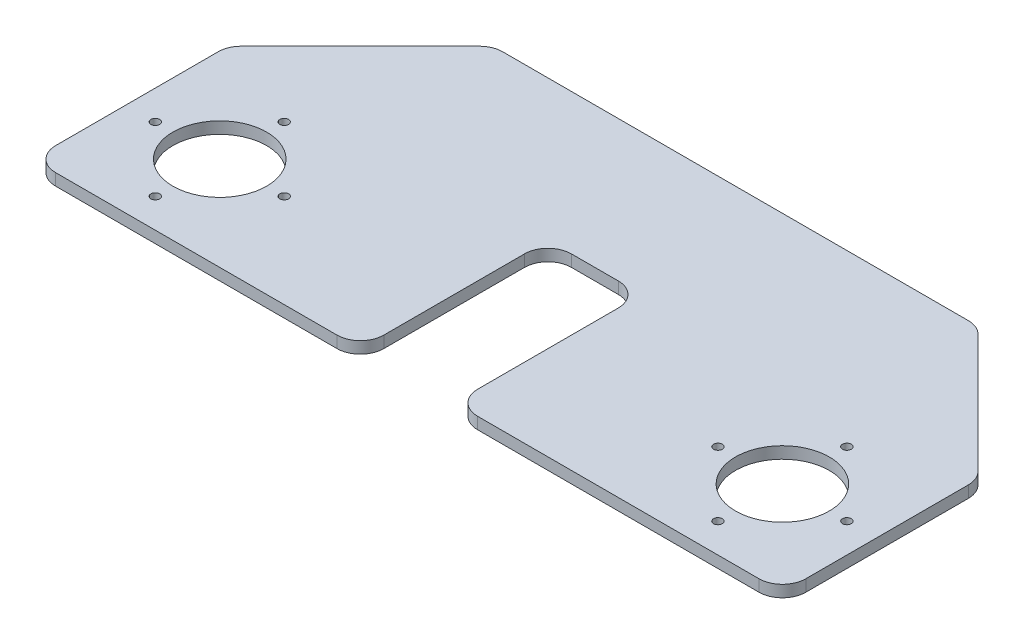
ISO-10303-21;
HEADER;
FILE_DESCRIPTION(('STEP AP214'),'2;1');
FILE_NAME('part.step','',(''),(''),'','','');
FILE_SCHEMA(('AUTOMOTIVE_DESIGN { 1 0 10303 214 1 1 1 1 }'));
ENDSEC;
DATA;
#1=APPLICATION_CONTEXT('core data for automotive mechanical design processes');
#2=APPLICATION_PROTOCOL_DEFINITION('international standard','automotive_design',2000,#1);
#3=PRODUCT_CONTEXT('',#1,'mechanical');
#4=PRODUCT('Part','Part','',(#3));
#5=PRODUCT_RELATED_PRODUCT_CATEGORY('part','',(#4));
#6=PRODUCT_DEFINITION_FORMATION('','',#4);
#7=PRODUCT_DEFINITION_CONTEXT('part definition',#1,'design');
#8=PRODUCT_DEFINITION('design','',#6,#7);
#9=PRODUCT_DEFINITION_SHAPE('','',#8);
#10=(LENGTH_UNIT() NAMED_UNIT(*) SI_UNIT(.MILLI.,.METRE.));
#11=(NAMED_UNIT(*) PLANE_ANGLE_UNIT() SI_UNIT($,.RADIAN.));
#12=(NAMED_UNIT(*) SI_UNIT($,.STERADIAN.) SOLID_ANGLE_UNIT());
#13=UNCERTAINTY_MEASURE_WITH_UNIT(LENGTH_MEASURE(1.E-05),#10,'distance_accuracy_value','');
#14=(GEOMETRIC_REPRESENTATION_CONTEXT(3) GLOBAL_UNCERTAINTY_ASSIGNED_CONTEXT((#13)) GLOBAL_UNIT_ASSIGNED_CONTEXT((#10,
#11,#12)) REPRESENTATION_CONTEXT('',''));
#15=CARTESIAN_POINT('',(0.,0.,0.));
#16=DIRECTION('',(0.,0.,1.));
#17=DIRECTION('',(1.,0.,0.));
#18=AXIS2_PLACEMENT_3D('',#15,#16,#17);
#19=CARTESIAN_POINT('',(-203.2,-6.35000000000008,50.8));
#20=DIRECTION('',(-1.,0.,0.));
#21=DIRECTION('',(0.,0.,1.));
#22=AXIS2_PLACEMENT_3D('',#19,#20,#21);
#23=PLANE('',#22);
#24=DIRECTION('',(0.,0.,1.));
#25=VECTOR('',#24,1.);
#26=CARTESIAN_POINT('',(-203.2,0.,50.8));
#27=LINE('',#26,#25);
#28=CARTESIAN_POINT('',(-203.2,0.,-49.8974387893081));
#29=VERTEX_POINT('',#28);
#30=CARTESIAN_POINT('',(-203.2,0.,38.1));
#31=VERTEX_POINT('',#30);
#32=EDGE_CURVE('E320',#29,#31,#27,.T.);
#33=ORIENTED_EDGE('',*,*,#32,.F.);
#34=DIRECTION('',(0.,1.,0.));
#35=VECTOR('',#34,1.);
#36=CARTESIAN_POINT('',(-203.2,-6.35000000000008,-49.8974387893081));
#37=LINE('',#36,#35);
#38=CARTESIAN_POINT('',(-203.2,-6.35000000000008,-49.8974387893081));
#39=VERTEX_POINT('',#38);
#40=EDGE_CURVE('E271',#29,#39,#37,.F.);
#41=ORIENTED_EDGE('',*,*,#40,.T.);
#42=DIRECTION('',(0.,0.,1.));
#43=VECTOR('',#42,1.);
#44=CARTESIAN_POINT('',(-203.2,-6.35000000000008,50.8));
#45=LINE('',#44,#43);
#46=CARTESIAN_POINT('',(-203.2,-6.35000000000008,38.1));
#47=VERTEX_POINT('',#46);
#48=EDGE_CURVE('E337',#39,#47,#45,.T.);
#49=ORIENTED_EDGE('',*,*,#48,.T.);
#50=DIRECTION('',(0.,1.,0.));
#51=VECTOR('',#50,1.);
#52=CARTESIAN_POINT('',(-203.2,-6.35000000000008,38.1));
#53=LINE('',#52,#51);
#54=EDGE_CURVE('E268',#47,#31,#53,.T.);
#55=ORIENTED_EDGE('',*,*,#54,.T.);
#56=EDGE_LOOP('',(#33,#41,#49,#55));
#57=FACE_BOUND('',#56,.T.);
#58=ADVANCED_FACE('F32',(#57),#23,.T.);
#59=CARTESIAN_POINT('',(-131.357951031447,-6.35000000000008,-127.));
#60=DIRECTION('',(-0.707106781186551,0.,-0.707106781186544));
#61=DIRECTION('',(-0.707106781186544,0.,0.707106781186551));
#62=AXIS2_PLACEMENT_3D('',#59,#60,#61);
#63=PLANE('',#62);
#64=DIRECTION('',(-0.707106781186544,0.,0.707106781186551));
#65=VECTOR('',#64,1.);
#66=CARTESIAN_POINT('',(-131.357951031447,0.,-127.));
#67=LINE('',#66,#65);
#68=CARTESIAN_POINT('',(-135.077694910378,0.,-123.280256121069));
#69=VERTEX_POINT('',#68);
#70=CARTESIAN_POINT('',(-199.480256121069,0.,-58.8776949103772));
#71=VERTEX_POINT('',#70);
#72=EDGE_CURVE('E201',#69,#71,#67,.T.);
#73=ORIENTED_EDGE('',*,*,#72,.F.);
#74=DIRECTION('',(0.,1.,0.));
#75=VECTOR('',#74,1.);
#76=CARTESIAN_POINT('',(-135.077694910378,-6.35000000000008,-123.280256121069));
#77=LINE('',#76,#75);
#78=CARTESIAN_POINT('',(-135.077694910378,-6.35000000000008,-123.280256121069));
#79=VERTEX_POINT('',#78);
#80=EDGE_CURVE('E266',#69,#79,#77,.F.);
#81=ORIENTED_EDGE('',*,*,#80,.T.);
#82=DIRECTION('',(-0.707106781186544,0.,0.707106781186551));
#83=VECTOR('',#82,1.);
#84=CARTESIAN_POINT('',(-131.357951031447,-6.35000000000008,-127.));
#85=LINE('',#84,#83);
#86=CARTESIAN_POINT('',(-199.480256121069,-6.35000000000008,-58.8776949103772));
#87=VERTEX_POINT('',#86);
#88=EDGE_CURVE('E193',#79,#87,#85,.T.);
#89=ORIENTED_EDGE('',*,*,#88,.T.);
#90=DIRECTION('',(0.,1.,0.));
#91=VECTOR('',#90,1.);
#92=CARTESIAN_POINT('',(-199.480256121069,-6.35000000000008,-58.8776949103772));
#93=LINE('',#92,#91);
#94=EDGE_CURVE('E263',#87,#71,#93,.T.);
#95=ORIENTED_EDGE('',*,*,#94,.T.);
#96=EDGE_LOOP('',(#73,#81,#89,#95));
#97=FACE_BOUND('',#96,.T.);
#98=ADVANCED_FACE('F450',(#97),#63,.T.);
#99=CARTESIAN_POINT('',(-131.357951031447,-6.35000000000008,-127.));
#100=DIRECTION('',(0.,0.,-1.));
#101=DIRECTION('',(-1.,0.,0.));
#102=AXIS2_PLACEMENT_3D('',#99,#100,#101);
#103=PLANE('',#102);
#104=DIRECTION('',(-1.,0.,0.));
#105=VECTOR('',#104,1.);
#106=CARTESIAN_POINT('',(-131.357951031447,0.,-127.));
#107=LINE('',#106,#105);
#108=CARTESIAN_POINT('',(126.097438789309,0.,-127.));
#109=VERTEX_POINT('',#108);
#110=CARTESIAN_POINT('',(-126.097438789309,0.,-127.));
#111=VERTEX_POINT('',#110);
#112=EDGE_CURVE('E333',#109,#111,#107,.T.);
#113=ORIENTED_EDGE('',*,*,#112,.F.);
#114=DIRECTION('',(0.,1.,0.));
#115=VECTOR('',#114,1.);
#116=CARTESIAN_POINT('',(126.097438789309,-6.35000000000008,-127.));
#117=LINE('',#116,#115);
#118=CARTESIAN_POINT('',(126.097438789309,-6.35000000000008,-127.));
#119=VERTEX_POINT('',#118);
#120=EDGE_CURVE('E261',#109,#119,#117,.F.);
#121=ORIENTED_EDGE('',*,*,#120,.T.);
#122=DIRECTION('',(-1.,0.,0.));
#123=VECTOR('',#122,1.);
#124=CARTESIAN_POINT('',(-131.357951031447,-6.35000000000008,-127.));
#125=LINE('',#124,#123);
#126=CARTESIAN_POINT('',(-126.097438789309,-6.35000000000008,-127.));
#127=VERTEX_POINT('',#126);
#128=EDGE_CURVE('E198',#119,#127,#125,.T.);
#129=ORIENTED_EDGE('',*,*,#128,.T.);
#130=DIRECTION('',(0.,1.,0.));
#131=VECTOR('',#130,1.);
#132=CARTESIAN_POINT('',(-126.097438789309,-6.35000000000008,-127.));
#133=LINE('',#132,#131);
#134=EDGE_CURVE('E258',#127,#111,#133,.T.);
#135=ORIENTED_EDGE('',*,*,#134,.T.);
#136=EDGE_LOOP('',(#113,#121,#129,#135));
#137=FACE_BOUND('',#136,.T.);
#138=ADVANCED_FACE('F455',(#137),#103,.T.);
#139=CARTESIAN_POINT('',(131.357951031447,-6.35000000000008,-127.));
#140=DIRECTION('',(0.707106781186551,0.,-0.707106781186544));
#141=DIRECTION('',(-0.707106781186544,0.,-0.707106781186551));
#142=AXIS2_PLACEMENT_3D('',#139,#140,#141);
#143=PLANE('',#142);
#144=DIRECTION('',(-0.707106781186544,0.,-0.707106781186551));
#145=VECTOR('',#144,1.);
#146=CARTESIAN_POINT('',(131.357951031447,0.,-127.));
#147=LINE('',#146,#145);
#148=CARTESIAN_POINT('',(199.480256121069,0.,-58.8776949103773));
#149=VERTEX_POINT('',#148);
#150=CARTESIAN_POINT('',(135.077694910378,0.,-123.280256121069));
#151=VERTEX_POINT('',#150);
#152=EDGE_CURVE('E331',#149,#151,#147,.T.);
#153=ORIENTED_EDGE('',*,*,#152,.F.);
#154=DIRECTION('',(0.,1.,0.));
#155=VECTOR('',#154,1.);
#156=CARTESIAN_POINT('',(199.480256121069,-6.35000000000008,-58.8776949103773));
#157=LINE('',#156,#155);
#158=CARTESIAN_POINT('',(199.480256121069,-6.35000000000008,-58.8776949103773));
#159=VERTEX_POINT('',#158);
#160=EDGE_CURVE('E256',#149,#159,#157,.F.);
#161=ORIENTED_EDGE('',*,*,#160,.T.);
#162=DIRECTION('',(-0.707106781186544,0.,-0.707106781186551));
#163=VECTOR('',#162,1.);
#164=CARTESIAN_POINT('',(131.357951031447,-6.35000000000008,-127.));
#165=LINE('',#164,#163);
#166=CARTESIAN_POINT('',(135.077694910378,-6.35000000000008,-123.280256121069));
#167=VERTEX_POINT('',#166);
#168=EDGE_CURVE('E315',#159,#167,#165,.T.);
#169=ORIENTED_EDGE('',*,*,#168,.T.);
#170=DIRECTION('',(0.,1.,0.));
#171=VECTOR('',#170,1.);
#172=CARTESIAN_POINT('',(135.077694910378,-6.35000000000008,-123.280256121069));
#173=LINE('',#172,#171);
#174=EDGE_CURVE('E253',#167,#151,#173,.T.);
#175=ORIENTED_EDGE('',*,*,#174,.T.);
#176=EDGE_LOOP('',(#153,#161,#169,#175));
#177=FACE_BOUND('',#176,.T.);
#178=ADVANCED_FACE('F512',(#177),#143,.T.);
#179=CARTESIAN_POINT('',(203.2,-6.35000000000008,50.8));
#180=DIRECTION('',(1.,0.,0.));
#181=DIRECTION('',(0.,0.,-1.));
#182=AXIS2_PLACEMENT_3D('',#179,#180,#181);
#183=PLANE('',#182);
#184=DIRECTION('',(0.,0.,-1.));
#185=VECTOR('',#184,1.);
#186=CARTESIAN_POINT('',(203.2,0.,50.8));
#187=LINE('',#186,#185);
#188=CARTESIAN_POINT('',(203.2,0.,38.0999999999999));
#189=VERTEX_POINT('',#188);
#190=CARTESIAN_POINT('',(203.2,0.,-49.8974387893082));
#191=VERTEX_POINT('',#190);
#192=EDGE_CURVE('E328',#189,#191,#187,.T.);
#193=ORIENTED_EDGE('',*,*,#192,.F.);
#194=DIRECTION('',(0.,1.,0.));
#195=VECTOR('',#194,1.);
#196=CARTESIAN_POINT('',(203.2,-6.35000000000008,38.0999999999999));
#197=LINE('',#196,#195);
#198=CARTESIAN_POINT('',(203.2,-6.35000000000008,38.0999999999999));
#199=VERTEX_POINT('',#198);
#200=EDGE_CURVE('E251',#189,#199,#197,.F.);
#201=ORIENTED_EDGE('',*,*,#200,.T.);
#202=DIRECTION('',(0.,0.,-1.));
#203=VECTOR('',#202,1.);
#204=CARTESIAN_POINT('',(203.2,-6.35000000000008,50.8));
#205=LINE('',#204,#203);
#206=CARTESIAN_POINT('',(203.2,-6.35000000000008,-49.8974387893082));
#207=VERTEX_POINT('',#206);
#208=EDGE_CURVE('E312',#199,#207,#205,.T.);
#209=ORIENTED_EDGE('',*,*,#208,.T.);
#210=DIRECTION('',(0.,1.,0.));
#211=VECTOR('',#210,1.);
#212=CARTESIAN_POINT('',(203.2,-6.35000000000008,-49.8974387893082));
#213=LINE('',#212,#211);
#214=EDGE_CURVE('E248',#207,#191,#213,.T.);
#215=ORIENTED_EDGE('',*,*,#214,.T.);
#216=EDGE_LOOP('',(#193,#201,#209,#215));
#217=FACE_BOUND('',#216,.T.);
#218=ADVANCED_FACE('F519',(#217),#183,.T.);
#219=CARTESIAN_POINT('',(25.4,-6.35000000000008,50.8));
#220=DIRECTION('',(0.,0.,1.));
#221=DIRECTION('',(1.,0.,0.));
#222=AXIS2_PLACEMENT_3D('',#219,#220,#221);
#223=PLANE('',#222);
#224=DIRECTION('',(1.,0.,0.));
#225=VECTOR('',#224,1.);
#226=CARTESIAN_POINT('',(25.4,0.,50.8));
#227=LINE('',#226,#225);
#228=CARTESIAN_POINT('',(38.1,0.,50.8));
#229=VERTEX_POINT('',#228);
#230=CARTESIAN_POINT('',(190.5,0.,50.8));
#231=VERTEX_POINT('',#230);
#232=EDGE_CURVE('E288',#229,#231,#227,.T.);
#233=ORIENTED_EDGE('',*,*,#232,.F.);
#234=DIRECTION('',(0.,1.,0.));
#235=VECTOR('',#234,1.);
#236=CARTESIAN_POINT('',(38.1,-6.35000000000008,50.8));
#237=LINE('',#236,#235);
#238=CARTESIAN_POINT('',(38.1,-6.35000000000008,50.8));
#239=VERTEX_POINT('',#238);
#240=EDGE_CURVE('E228',#229,#239,#237,.F.);
#241=ORIENTED_EDGE('',*,*,#240,.T.);
#242=DIRECTION('',(1.,0.,0.));
#243=VECTOR('',#242,1.);
#244=CARTESIAN_POINT('',(25.4,-6.35000000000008,50.8));
#245=LINE('',#244,#243);
#246=CARTESIAN_POINT('',(190.5,-6.35000000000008,50.8));
#247=VERTEX_POINT('',#246);
#248=EDGE_CURVE('E304',#239,#247,#245,.T.);
#249=ORIENTED_EDGE('',*,*,#248,.T.);
#250=DIRECTION('',(0.,1.,0.));
#251=VECTOR('',#250,1.);
#252=CARTESIAN_POINT('',(190.5,-6.35000000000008,50.8));
#253=LINE('',#252,#251);
#254=EDGE_CURVE('E225',#247,#231,#253,.T.);
#255=ORIENTED_EDGE('',*,*,#254,.T.);
#256=EDGE_LOOP('',(#233,#241,#249,#255));
#257=FACE_BOUND('',#256,.T.);
#258=ADVANCED_FACE('F525',(#257),#223,.T.);
#259=CARTESIAN_POINT('',(25.4,-6.35000000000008,50.8));
#260=DIRECTION('',(-1.,0.,0.));
#261=DIRECTION('',(0.,0.,1.));
#262=AXIS2_PLACEMENT_3D('',#259,#260,#261);
#263=PLANE('',#262);
#264=DIRECTION('',(0.,0.,1.));
#265=VECTOR('',#264,1.);
#266=CARTESIAN_POINT('',(25.4,0.,50.8));
#267=LINE('',#266,#265);
#268=CARTESIAN_POINT('',(25.4,0.,-38.1));
#269=VERTEX_POINT('',#268);
#270=CARTESIAN_POINT('',(25.4,0.,38.1));
#271=VERTEX_POINT('',#270);
#272=EDGE_CURVE('E278',#269,#271,#267,.T.);
#273=ORIENTED_EDGE('',*,*,#272,.F.);
#274=DIRECTION('',(0.,1.,0.));
#275=VECTOR('',#274,1.);
#276=CARTESIAN_POINT('',(25.4,-6.35000000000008,-38.1));
#277=LINE('',#276,#275);
#278=CARTESIAN_POINT('',(25.4,-6.35000000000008,-38.1));
#279=VERTEX_POINT('',#278);
#280=EDGE_CURVE('E211',#269,#279,#277,.F.);
#281=ORIENTED_EDGE('',*,*,#280,.T.);
#282=DIRECTION('',(0.,0.,1.));
#283=VECTOR('',#282,1.);
#284=CARTESIAN_POINT('',(25.4,-6.35000000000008,50.8));
#285=LINE('',#284,#283);
#286=CARTESIAN_POINT('',(25.4,-6.35000000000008,38.1));
#287=VERTEX_POINT('',#286);
#288=EDGE_CURVE('E298',#279,#287,#285,.T.);
#289=ORIENTED_EDGE('',*,*,#288,.T.);
#290=DIRECTION('',(0.,1.,0.));
#291=VECTOR('',#290,1.);
#292=CARTESIAN_POINT('',(25.4,-6.35000000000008,38.1));
#293=LINE('',#292,#291);
#294=EDGE_CURVE('E208',#287,#271,#293,.T.);
#295=ORIENTED_EDGE('',*,*,#294,.T.);
#296=EDGE_LOOP('',(#273,#281,#289,#295));
#297=FACE_BOUND('',#296,.T.);
#298=ADVANCED_FACE('F284',(#297),#263,.T.);
#299=CARTESIAN_POINT('',(-25.4,-6.35000000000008,-50.8));
#300=DIRECTION('',(0.,0.,1.));
#301=DIRECTION('',(1.,0.,0.));
#302=AXIS2_PLACEMENT_3D('',#299,#300,#301);
#303=PLANE('',#302);
#304=DIRECTION('',(1.,0.,0.));
#305=VECTOR('',#304,1.);
#306=CARTESIAN_POINT('',(-25.4,0.,-50.8));
#307=LINE('',#306,#305);
#308=CARTESIAN_POINT('',(-12.7,0.,-50.8));
#309=VERTEX_POINT('',#308);
#310=CARTESIAN_POINT('',(12.7,0.,-50.8));
#311=VERTEX_POINT('',#310);
#312=EDGE_CURVE('E190',#309,#311,#307,.T.);
#313=ORIENTED_EDGE('',*,*,#312,.F.);
#314=DIRECTION('',(0.,1.,0.));
#315=VECTOR('',#314,1.);
#316=CARTESIAN_POINT('',(-12.7,-6.35000000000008,-50.8));
#317=LINE('',#316,#315);
#318=CARTESIAN_POINT('',(-12.7,-6.35000000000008,-50.8));
#319=VERTEX_POINT('',#318);
#320=EDGE_CURVE('E206',#309,#319,#317,.F.);
#321=ORIENTED_EDGE('',*,*,#320,.T.);
#322=DIRECTION('',(1.,0.,0.));
#323=VECTOR('',#322,1.);
#324=CARTESIAN_POINT('',(-25.4,-6.35000000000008,-50.8));
#325=LINE('',#324,#323);
#326=CARTESIAN_POINT('',(12.7,-6.35000000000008,-50.8));
#327=VERTEX_POINT('',#326);
#328=EDGE_CURVE('E296',#319,#327,#325,.T.);
#329=ORIENTED_EDGE('',*,*,#328,.T.);
#330=DIRECTION('',(0.,1.,0.));
#331=VECTOR('',#330,1.);
#332=CARTESIAN_POINT('',(12.7,0.,-50.8));
#333=LINE('',#332,#331);
#334=EDGE_CURVE('E195',#327,#311,#333,.T.);
#335=ORIENTED_EDGE('',*,*,#334,.T.);
#336=EDGE_LOOP('',(#313,#321,#329,#335));
#337=FACE_BOUND('',#336,.T.);
#338=ADVANCED_FACE('F300',(#337),#303,.T.);
#339=CARTESIAN_POINT('',(-25.4,-6.35000000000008,50.8));
#340=DIRECTION('',(1.,0.,0.));
#341=DIRECTION('',(0.,0.,-1.));
#342=AXIS2_PLACEMENT_3D('',#339,#340,#341);
#343=PLANE('',#342);
#344=DIRECTION('',(0.,0.,-1.));
#345=VECTOR('',#344,1.);
#346=CARTESIAN_POINT('',(-25.4,-6.35000000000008,50.8));
#347=LINE('',#346,#345);
#348=CARTESIAN_POINT('',(-25.4,-6.35000000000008,38.1));
#349=VERTEX_POINT('',#348);
#350=CARTESIAN_POINT('',(-25.4,-6.35000000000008,-38.1));
#351=VERTEX_POINT('',#350);
#352=EDGE_CURVE('E302',#349,#351,#347,.T.);
#353=ORIENTED_EDGE('',*,*,#352,.T.);
#354=DIRECTION('',(0.,1.,0.));
#355=VECTOR('',#354,1.);
#356=CARTESIAN_POINT('',(-25.4,0.,-38.1));
#357=LINE('',#356,#355);
#358=CARTESIAN_POINT('',(-25.4,0.,-38.1));
#359=VERTEX_POINT('',#358);
#360=EDGE_CURVE('E189',#351,#359,#357,.T.);
#361=ORIENTED_EDGE('',*,*,#360,.T.);
#362=DIRECTION('',(0.,0.,-1.));
#363=VECTOR('',#362,1.);
#364=CARTESIAN_POINT('',(-25.4,0.,50.8));
#365=LINE('',#364,#363);
#366=CARTESIAN_POINT('',(-25.4,0.,38.1));
#367=VERTEX_POINT('',#366);
#368=EDGE_CURVE('E174',#367,#359,#365,.T.);
#369=ORIENTED_EDGE('',*,*,#368,.F.);
#370=DIRECTION('',(0.,1.,0.));
#371=VECTOR('',#370,1.);
#372=CARTESIAN_POINT('',(-25.4,-6.35000000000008,38.1));
#373=LINE('',#372,#371);
#374=EDGE_CURVE('E187',#367,#349,#373,.F.);
#375=ORIENTED_EDGE('',*,*,#374,.T.);
#376=EDGE_LOOP('',(#353,#361,#369,#375));
#377=FACE_BOUND('',#376,.T.);
#378=ADVANCED_FACE('F186',(#377),#343,.T.);
#379=CARTESIAN_POINT('',(-203.2,-6.35000000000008,50.8));
#380=DIRECTION('',(0.,0.,1.));
#381=DIRECTION('',(1.,0.,0.));
#382=AXIS2_PLACEMENT_3D('',#379,#380,#381);
#383=PLANE('',#382);
#384=DIRECTION('',(1.,0.,0.));
#385=VECTOR('',#384,1.);
#386=CARTESIAN_POINT('',(-203.2,-6.35000000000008,50.8));
#387=LINE('',#386,#385);
#388=CARTESIAN_POINT('',(-190.5,-6.35000000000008,50.8));
#389=VERTEX_POINT('',#388);
#390=CARTESIAN_POINT('',(-38.1,-6.35000000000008,50.8));
#391=VERTEX_POINT('',#390);
#392=EDGE_CURVE('E306',#389,#391,#387,.T.);
#393=ORIENTED_EDGE('',*,*,#392,.T.);
#394=DIRECTION('',(0.,1.,0.));
#395=VECTOR('',#394,1.);
#396=CARTESIAN_POINT('',(-38.1,-6.35000000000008,50.8));
#397=LINE('',#396,#395);
#398=CARTESIAN_POINT('',(-38.1,0.,50.8));
#399=VERTEX_POINT('',#398);
#400=EDGE_CURVE('E246',#391,#399,#397,.T.);
#401=ORIENTED_EDGE('',*,*,#400,.T.);
#402=DIRECTION('',(1.,0.,0.));
#403=VECTOR('',#402,1.);
#404=CARTESIAN_POINT('',(-203.2,0.,50.8));
#405=LINE('',#404,#403);
#406=CARTESIAN_POINT('',(-190.5,0.,50.8));
#407=VERTEX_POINT('',#406);
#408=EDGE_CURVE('E175',#407,#399,#405,.T.);
#409=ORIENTED_EDGE('',*,*,#408,.F.);
#410=DIRECTION('',(0.,1.,0.));
#411=VECTOR('',#410,1.);
#412=CARTESIAN_POINT('',(-190.5,-6.35000000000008,50.8));
#413=LINE('',#412,#411);
#414=EDGE_CURVE('E54',#407,#389,#413,.F.);
#415=ORIENTED_EDGE('',*,*,#414,.T.);
#416=EDGE_LOOP('',(#393,#401,#409,#415));
#417=FACE_BOUND('',#416,.T.);
#418=ADVANCED_FACE('F461',(#417),#383,.T.);
#419=CARTESIAN_POINT('',(0.,-6.35000000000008,0.));
#420=DIRECTION('',(0.,-1.,0.));
#421=DIRECTION('',(0.,0.,-1.));
#422=AXIS2_PLACEMENT_3D('',#419,#420,#421);
#423=PLANE('',#422);
#424=CARTESIAN_POINT('',(152.4,-6.35000000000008,34.925));
#425=DIRECTION('',(0.,1.,0.));
#426=DIRECTION('',(0.,0.,1.));
#427=AXIS2_PLACEMENT_3D('',#424,#425,#426);
#428=CIRCLE('',#427,2.37490000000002);
#429=CARTESIAN_POINT('',(152.4,-6.35000000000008,37.2999));
#430=VERTEX_POINT('',#429);
#431=EDGE_CURVE('E396',#430,#430,#428,.T.);
#432=ORIENTED_EDGE('',*,*,#431,.T.);
#433=EDGE_LOOP('',(#432));
#434=FACE_BOUND('',#433,.T.);
#435=CARTESIAN_POINT('',(187.325,-6.35000000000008,0.));
#436=DIRECTION('',(0.,1.,0.));
#437=DIRECTION('',(0.,0.,1.));
#438=AXIS2_PLACEMENT_3D('',#435,#436,#437);
#439=CIRCLE('',#438,2.37490000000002);
#440=CARTESIAN_POINT('',(187.325,-6.35000000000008,2.37490000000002));
#441=VERTEX_POINT('',#440);
#442=EDGE_CURVE('E390',#441,#441,#439,.T.);
#443=ORIENTED_EDGE('',*,*,#442,.T.);
#444=EDGE_LOOP('',(#443));
#445=FACE_BOUND('',#444,.T.);
#446=CARTESIAN_POINT('',(152.4,-6.35000000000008,-34.925));
#447=DIRECTION('',(0.,1.,0.));
#448=DIRECTION('',(0.,0.,1.));
#449=AXIS2_PLACEMENT_3D('',#446,#447,#448);
#450=CIRCLE('',#449,2.37490000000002);
#451=CARTESIAN_POINT('',(152.4,-6.35000000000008,-32.5501));
#452=VERTEX_POINT('',#451);
#453=EDGE_CURVE('E384',#452,#452,#450,.T.);
#454=ORIENTED_EDGE('',*,*,#453,.T.);
#455=EDGE_LOOP('',(#454));
#456=FACE_BOUND('',#455,.T.);
#457=CARTESIAN_POINT('',(117.475,-6.35000000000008,0.));
#458=DIRECTION('',(0.,1.,0.));
#459=DIRECTION('',(0.,0.,1.));
#460=AXIS2_PLACEMENT_3D('',#457,#458,#459);
#461=CIRCLE('',#460,2.37490000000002);
#462=CARTESIAN_POINT('',(117.475,-6.35000000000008,2.37490000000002));
#463=VERTEX_POINT('',#462);
#464=EDGE_CURVE('E378',#463,#463,#461,.T.);
#465=ORIENTED_EDGE('',*,*,#464,.T.);
#466=EDGE_LOOP('',(#465));
#467=FACE_BOUND('',#466,.T.);
#468=CARTESIAN_POINT('',(-187.325,-6.35000000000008,0.));
#469=DIRECTION('',(0.,1.,0.));
#470=DIRECTION('',(0.,0.,1.));
#471=AXIS2_PLACEMENT_3D('',#468,#469,#470);
#472=CIRCLE('',#471,2.37490000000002);
#473=CARTESIAN_POINT('',(-187.325,-6.35000000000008,2.37490000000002));
#474=VERTEX_POINT('',#473);
#475=EDGE_CURVE('E372',#474,#474,#472,.T.);
#476=ORIENTED_EDGE('',*,*,#475,.T.);
#477=EDGE_LOOP('',(#476));
#478=FACE_BOUND('',#477,.T.);
#479=CARTESIAN_POINT('',(-117.475,-6.35000000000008,0.));
#480=DIRECTION('',(0.,1.,0.));
#481=DIRECTION('',(0.,0.,1.));
#482=AXIS2_PLACEMENT_3D('',#479,#480,#481);
#483=CIRCLE('',#482,2.37490000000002);
#484=CARTESIAN_POINT('',(-117.475,-6.35000000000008,2.37490000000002));
#485=VERTEX_POINT('',#484);
#486=EDGE_CURVE('E366',#485,#485,#483,.T.);
#487=ORIENTED_EDGE('',*,*,#486,.T.);
#488=EDGE_LOOP('',(#487));
#489=FACE_BOUND('',#488,.T.);
#490=CARTESIAN_POINT('',(-152.400000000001,-6.35000000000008,34.925));
#491=DIRECTION('',(0.,1.,0.));
#492=DIRECTION('',(0.,0.,1.));
#493=AXIS2_PLACEMENT_3D('',#490,#491,#492);
#494=CIRCLE('',#493,2.37490000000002);
#495=CARTESIAN_POINT('',(-152.400000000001,-6.35000000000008,37.2999));
#496=VERTEX_POINT('',#495);
#497=EDGE_CURVE('E360',#496,#496,#494,.T.);
#498=ORIENTED_EDGE('',*,*,#497,.T.);
#499=EDGE_LOOP('',(#498));
#500=FACE_BOUND('',#499,.T.);
#501=CARTESIAN_POINT('',(-152.4,-6.35000000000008,-34.925));
#502=DIRECTION('',(0.,1.,0.));
#503=DIRECTION('',(0.,0.,1.));
#504=AXIS2_PLACEMENT_3D('',#501,#502,#503);
#505=CIRCLE('',#504,2.37490000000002);
#506=CARTESIAN_POINT('',(-152.4,-6.35000000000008,-32.5501));
#507=VERTEX_POINT('',#506);
#508=EDGE_CURVE('E354',#507,#507,#505,.T.);
#509=ORIENTED_EDGE('',*,*,#508,.T.);
#510=EDGE_LOOP('',(#509));
#511=FACE_BOUND('',#510,.T.);
#512=CARTESIAN_POINT('',(152.4,-6.35000000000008,0.));
#513=DIRECTION('',(0.,1.,0.));
#514=DIRECTION('',(0.,0.,1.));
#515=AXIS2_PLACEMENT_3D('',#512,#513,#514);
#516=CIRCLE('',#515,25.4);
#517=CARTESIAN_POINT('',(152.4,-6.35000000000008,25.4));
#518=VERTEX_POINT('',#517);
#519=EDGE_CURVE('E348',#518,#518,#516,.T.);
#520=ORIENTED_EDGE('',*,*,#519,.T.);
#521=EDGE_LOOP('',(#520));
#522=FACE_BOUND('',#521,.T.);
#523=CARTESIAN_POINT('',(-152.4,-6.35000000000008,0.));
#524=DIRECTION('',(0.,1.,0.));
#525=DIRECTION('',(0.,0.,1.));
#526=AXIS2_PLACEMENT_3D('',#523,#524,#525);
#527=CIRCLE('',#526,25.4);
#528=CARTESIAN_POINT('',(-152.4,-6.35000000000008,25.4));
#529=VERTEX_POINT('',#528);
#530=EDGE_CURVE('E323',#529,#529,#527,.T.);
#531=ORIENTED_EDGE('',*,*,#530,.T.);
#532=EDGE_LOOP('',(#531));
#533=FACE_BOUND('',#532,.T.);
#534=ORIENTED_EDGE('',*,*,#248,.F.);
#535=CARTESIAN_POINT('',(38.1,-6.35000000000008,38.1));
#536=DIRECTION('',(0.,-1.,0.));
#537=DIRECTION('',(0.,0.,-1.));
#538=AXIS2_PLACEMENT_3D('',#535,#536,#537);
#539=CIRCLE('',#538,12.7);
#540=EDGE_CURVE('E243',#239,#287,#539,.T.);
#541=ORIENTED_EDGE('',*,*,#540,.T.);
#542=ORIENTED_EDGE('',*,*,#288,.F.);
#543=CARTESIAN_POINT('',(12.7,-6.35000000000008,-38.1));
#544=DIRECTION('',(0.,-1.,0.));
#545=DIRECTION('',(0.,0.,-1.));
#546=AXIS2_PLACEMENT_3D('',#543,#544,#545);
#547=CIRCLE('',#546,12.7);
#548=EDGE_CURVE('E11',#279,#327,#547,.F.);
#549=ORIENTED_EDGE('',*,*,#548,.T.);
#550=ORIENTED_EDGE('',*,*,#328,.F.);
#551=CARTESIAN_POINT('',(-12.7,-6.35000000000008,-38.1));
#552=DIRECTION('',(0.,-1.,0.));
#553=DIRECTION('',(0.,0.,-1.));
#554=AXIS2_PLACEMENT_3D('',#551,#552,#553);
#555=CIRCLE('',#554,12.7);
#556=EDGE_CURVE('E275',#319,#351,#555,.F.);
#557=ORIENTED_EDGE('',*,*,#556,.T.);
#558=ORIENTED_EDGE('',*,*,#352,.F.);
#559=CARTESIAN_POINT('',(-38.1,-6.35000000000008,38.1));
#560=DIRECTION('',(0.,-1.,0.));
#561=DIRECTION('',(0.,0.,-1.));
#562=AXIS2_PLACEMENT_3D('',#559,#560,#561);
#563=CIRCLE('',#562,12.7);
#564=EDGE_CURVE('E47',#349,#391,#563,.T.);
#565=ORIENTED_EDGE('',*,*,#564,.T.);
#566=ORIENTED_EDGE('',*,*,#392,.F.);
#567=CARTESIAN_POINT('',(-190.5,-6.35000000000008,38.1));
#568=DIRECTION('',(0.,-1.,0.));
#569=DIRECTION('',(0.,0.,-1.));
#570=AXIS2_PLACEMENT_3D('',#567,#568,#569);
#571=CIRCLE('',#570,12.7);
#572=EDGE_CURVE('E230',#389,#47,#571,.T.);
#573=ORIENTED_EDGE('',*,*,#572,.T.);
#574=ORIENTED_EDGE('',*,*,#48,.F.);
#575=CARTESIAN_POINT('',(-190.5,-6.35000000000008,-49.8974387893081));
#576=DIRECTION('',(0.,-1.,0.));
#577=DIRECTION('',(0.,0.,-1.));
#578=AXIS2_PLACEMENT_3D('',#575,#576,#577);
#579=CIRCLE('',#578,12.7);
#580=EDGE_CURVE('E232',#39,#87,#579,.T.);
#581=ORIENTED_EDGE('',*,*,#580,.T.);
#582=ORIENTED_EDGE('',*,*,#88,.F.);
#583=CARTESIAN_POINT('',(-126.097438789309,-6.35000000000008,-114.3));
#584=DIRECTION('',(0.,-1.,0.));
#585=DIRECTION('',(0.,0.,-1.));
#586=AXIS2_PLACEMENT_3D('',#583,#584,#585);
#587=CIRCLE('',#586,12.7);
#588=EDGE_CURVE('E234',#79,#127,#587,.T.);
#589=ORIENTED_EDGE('',*,*,#588,.T.);
#590=ORIENTED_EDGE('',*,*,#128,.F.);
#591=CARTESIAN_POINT('',(126.097438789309,-6.35000000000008,-114.3));
#592=DIRECTION('',(0.,-1.,0.));
#593=DIRECTION('',(0.,0.,-1.));
#594=AXIS2_PLACEMENT_3D('',#591,#592,#593);
#595=CIRCLE('',#594,12.7);
#596=EDGE_CURVE('E236',#119,#167,#595,.T.);
#597=ORIENTED_EDGE('',*,*,#596,.T.);
#598=ORIENTED_EDGE('',*,*,#168,.F.);
#599=CARTESIAN_POINT('',(190.5,-6.35000000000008,-49.8974387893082));
#600=DIRECTION('',(0.,-1.,0.));
#601=DIRECTION('',(0.,0.,-1.));
#602=AXIS2_PLACEMENT_3D('',#599,#600,#601);
#603=CIRCLE('',#602,12.7);
#604=EDGE_CURVE('E238',#159,#207,#603,.T.);
#605=ORIENTED_EDGE('',*,*,#604,.T.);
#606=ORIENTED_EDGE('',*,*,#208,.F.);
#607=CARTESIAN_POINT('',(190.5,-6.35000000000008,38.0999999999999));
#608=DIRECTION('',(0.,-1.,0.));
#609=DIRECTION('',(0.,0.,-1.));
#610=AXIS2_PLACEMENT_3D('',#607,#608,#609);
#611=CIRCLE('',#610,12.7);
#612=EDGE_CURVE('E240',#199,#247,#611,.T.);
#613=ORIENTED_EDGE('',*,*,#612,.T.);
#614=EDGE_LOOP('',(#534,#541,#542,#549,#550,#557,#558,#565,#566,#573,#574,#581,#582,#589,#590,
#597,#598,#605,#606,#613));
#615=FACE_BOUND('',#614,.T.);
#616=ADVANCED_FACE('F295',(#434,#445,#456,#467,#478,#489,#500,#511,#522,#533,#615),#423,.T.);
#617=CARTESIAN_POINT('',(0.,0.,0.));
#618=DIRECTION('',(0.,-1.,0.));
#619=DIRECTION('',(0.,0.,-1.));
#620=AXIS2_PLACEMENT_3D('',#617,#618,#619);
#621=PLANE('',#620);
#622=CARTESIAN_POINT('',(152.4,0.,34.925));
#623=DIRECTION('',(0.,1.,0.));
#624=DIRECTION('',(0.,0.,1.));
#625=AXIS2_PLACEMENT_3D('',#622,#623,#624);
#626=CIRCLE('',#625,2.37490000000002);
#627=CARTESIAN_POINT('',(152.4,0.,37.2999));
#628=VERTEX_POINT('',#627);
#629=EDGE_CURVE('E399',#628,#628,#626,.T.);
#630=ORIENTED_EDGE('',*,*,#629,.F.);
#631=EDGE_LOOP('',(#630));
#632=FACE_BOUND('',#631,.T.);
#633=CARTESIAN_POINT('',(187.325,0.,0.));
#634=DIRECTION('',(0.,1.,0.));
#635=DIRECTION('',(0.,0.,1.));
#636=AXIS2_PLACEMENT_3D('',#633,#634,#635);
#637=CIRCLE('',#636,2.37490000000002);
#638=CARTESIAN_POINT('',(187.325,0.,2.37490000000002));
#639=VERTEX_POINT('',#638);
#640=EDGE_CURVE('E393',#639,#639,#637,.T.);
#641=ORIENTED_EDGE('',*,*,#640,.F.);
#642=EDGE_LOOP('',(#641));
#643=FACE_BOUND('',#642,.T.);
#644=CARTESIAN_POINT('',(152.4,0.,-34.925));
#645=DIRECTION('',(0.,1.,0.));
#646=DIRECTION('',(0.,0.,1.));
#647=AXIS2_PLACEMENT_3D('',#644,#645,#646);
#648=CIRCLE('',#647,2.37490000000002);
#649=CARTESIAN_POINT('',(152.4,0.,-32.5501));
#650=VERTEX_POINT('',#649);
#651=EDGE_CURVE('E387',#650,#650,#648,.T.);
#652=ORIENTED_EDGE('',*,*,#651,.F.);
#653=EDGE_LOOP('',(#652));
#654=FACE_BOUND('',#653,.T.);
#655=CARTESIAN_POINT('',(117.475,0.,0.));
#656=DIRECTION('',(0.,1.,0.));
#657=DIRECTION('',(0.,0.,1.));
#658=AXIS2_PLACEMENT_3D('',#655,#656,#657);
#659=CIRCLE('',#658,2.37490000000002);
#660=CARTESIAN_POINT('',(117.475,0.,2.37490000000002));
#661=VERTEX_POINT('',#660);
#662=EDGE_CURVE('E381',#661,#661,#659,.T.);
#663=ORIENTED_EDGE('',*,*,#662,.F.);
#664=EDGE_LOOP('',(#663));
#665=FACE_BOUND('',#664,.T.);
#666=CARTESIAN_POINT('',(-187.325,0.,0.));
#667=DIRECTION('',(0.,1.,0.));
#668=DIRECTION('',(0.,0.,1.));
#669=AXIS2_PLACEMENT_3D('',#666,#667,#668);
#670=CIRCLE('',#669,2.37490000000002);
#671=CARTESIAN_POINT('',(-187.325,0.,2.37490000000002));
#672=VERTEX_POINT('',#671);
#673=EDGE_CURVE('E375',#672,#672,#670,.T.);
#674=ORIENTED_EDGE('',*,*,#673,.F.);
#675=EDGE_LOOP('',(#674));
#676=FACE_BOUND('',#675,.T.);
#677=CARTESIAN_POINT('',(-117.475,0.,0.));
#678=DIRECTION('',(0.,1.,0.));
#679=DIRECTION('',(0.,0.,1.));
#680=AXIS2_PLACEMENT_3D('',#677,#678,#679);
#681=CIRCLE('',#680,2.37490000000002);
#682=CARTESIAN_POINT('',(-117.475,0.,2.37490000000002));
#683=VERTEX_POINT('',#682);
#684=EDGE_CURVE('E369',#683,#683,#681,.T.);
#685=ORIENTED_EDGE('',*,*,#684,.F.);
#686=EDGE_LOOP('',(#685));
#687=FACE_BOUND('',#686,.T.);
#688=CARTESIAN_POINT('',(-152.400000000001,0.,34.925));
#689=DIRECTION('',(0.,1.,0.));
#690=DIRECTION('',(0.,0.,1.));
#691=AXIS2_PLACEMENT_3D('',#688,#689,#690);
#692=CIRCLE('',#691,2.37490000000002);
#693=CARTESIAN_POINT('',(-152.400000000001,0.,37.2999));
#694=VERTEX_POINT('',#693);
#695=EDGE_CURVE('E363',#694,#694,#692,.T.);
#696=ORIENTED_EDGE('',*,*,#695,.F.);
#697=EDGE_LOOP('',(#696));
#698=FACE_BOUND('',#697,.T.);
#699=CARTESIAN_POINT('',(-152.4,0.,-34.925));
#700=DIRECTION('',(0.,1.,0.));
#701=DIRECTION('',(0.,0.,1.));
#702=AXIS2_PLACEMENT_3D('',#699,#700,#701);
#703=CIRCLE('',#702,2.37490000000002);
#704=CARTESIAN_POINT('',(-152.4,0.,-32.5501));
#705=VERTEX_POINT('',#704);
#706=EDGE_CURVE('E357',#705,#705,#703,.T.);
#707=ORIENTED_EDGE('',*,*,#706,.F.);
#708=EDGE_LOOP('',(#707));
#709=FACE_BOUND('',#708,.T.);
#710=CARTESIAN_POINT('',(152.4,0.,0.));
#711=DIRECTION('',(0.,1.,0.));
#712=DIRECTION('',(0.,0.,1.));
#713=AXIS2_PLACEMENT_3D('',#710,#711,#712);
#714=CIRCLE('',#713,25.4);
#715=CARTESIAN_POINT('',(152.4,0.,25.4));
#716=VERTEX_POINT('',#715);
#717=EDGE_CURVE('E351',#716,#716,#714,.T.);
#718=ORIENTED_EDGE('',*,*,#717,.F.);
#719=EDGE_LOOP('',(#718));
#720=FACE_BOUND('',#719,.T.);
#721=CARTESIAN_POINT('',(-152.4,0.,0.));
#722=DIRECTION('',(0.,1.,0.));
#723=DIRECTION('',(0.,0.,1.));
#724=AXIS2_PLACEMENT_3D('',#721,#722,#723);
#725=CIRCLE('',#724,25.4);
#726=CARTESIAN_POINT('',(-152.4,0.,25.4));
#727=VERTEX_POINT('',#726);
#728=EDGE_CURVE('E345',#727,#727,#725,.T.);
#729=ORIENTED_EDGE('',*,*,#728,.F.);
#730=EDGE_LOOP('',(#729));
#731=FACE_BOUND('',#730,.T.);
#732=ORIENTED_EDGE('',*,*,#272,.T.);
#733=CARTESIAN_POINT('',(38.1,0.,38.1));
#734=DIRECTION('',(0.,-1.,0.));
#735=DIRECTION('',(0.,0.,-1.));
#736=AXIS2_PLACEMENT_3D('',#733,#734,#735);
#737=CIRCLE('',#736,12.7);
#738=EDGE_CURVE('E180',#271,#229,#737,.F.);
#739=ORIENTED_EDGE('',*,*,#738,.T.);
#740=ORIENTED_EDGE('',*,*,#232,.T.);
#741=CARTESIAN_POINT('',(190.5,0.,38.0999999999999));
#742=DIRECTION('',(0.,-1.,0.));
#743=DIRECTION('',(0.,0.,-1.));
#744=AXIS2_PLACEMENT_3D('',#741,#742,#743);
#745=CIRCLE('',#744,12.7);
#746=EDGE_CURVE('E181',#231,#189,#745,.F.);
#747=ORIENTED_EDGE('',*,*,#746,.T.);
#748=ORIENTED_EDGE('',*,*,#192,.T.);
#749=CARTESIAN_POINT('',(190.5,0.,-49.8974387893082));
#750=DIRECTION('',(0.,-1.,0.));
#751=DIRECTION('',(0.,0.,-1.));
#752=AXIS2_PLACEMENT_3D('',#749,#750,#751);
#753=CIRCLE('',#752,12.7);
#754=EDGE_CURVE('E221',#191,#149,#753,.F.);
#755=ORIENTED_EDGE('',*,*,#754,.T.);
#756=ORIENTED_EDGE('',*,*,#152,.T.);
#757=CARTESIAN_POINT('',(126.097438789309,0.,-114.3));
#758=DIRECTION('',(0.,-1.,0.));
#759=DIRECTION('',(0.,0.,-1.));
#760=AXIS2_PLACEMENT_3D('',#757,#758,#759);
#761=CIRCLE('',#760,12.7);
#762=EDGE_CURVE('E219',#151,#109,#761,.F.);
#763=ORIENTED_EDGE('',*,*,#762,.T.);
#764=ORIENTED_EDGE('',*,*,#112,.T.);
#765=CARTESIAN_POINT('',(-126.097438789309,0.,-114.3));
#766=DIRECTION('',(0.,-1.,0.));
#767=DIRECTION('',(0.,0.,-1.));
#768=AXIS2_PLACEMENT_3D('',#765,#766,#767);
#769=CIRCLE('',#768,12.7);
#770=EDGE_CURVE('E217',#111,#69,#769,.F.);
#771=ORIENTED_EDGE('',*,*,#770,.T.);
#772=ORIENTED_EDGE('',*,*,#72,.T.);
#773=CARTESIAN_POINT('',(-190.5,0.,-49.8974387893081));
#774=DIRECTION('',(0.,-1.,0.));
#775=DIRECTION('',(0.,0.,-1.));
#776=AXIS2_PLACEMENT_3D('',#773,#774,#775);
#777=CIRCLE('',#776,12.7);
#778=EDGE_CURVE('E215',#71,#29,#777,.F.);
#779=ORIENTED_EDGE('',*,*,#778,.T.);
#780=ORIENTED_EDGE('',*,*,#32,.T.);
#781=CARTESIAN_POINT('',(-190.5,0.,38.1));
#782=DIRECTION('',(0.,-1.,0.));
#783=DIRECTION('',(0.,0.,-1.));
#784=AXIS2_PLACEMENT_3D('',#781,#782,#783);
#785=CIRCLE('',#784,12.7);
#786=EDGE_CURVE('E213',#31,#407,#785,.F.);
#787=ORIENTED_EDGE('',*,*,#786,.T.);
#788=ORIENTED_EDGE('',*,*,#408,.T.);
#789=CARTESIAN_POINT('',(-38.1,0.,38.1));
#790=DIRECTION('',(0.,-1.,0.));
#791=DIRECTION('',(0.,0.,-1.));
#792=AXIS2_PLACEMENT_3D('',#789,#790,#791);
#793=CIRCLE('',#792,12.7);
#794=EDGE_CURVE('E170',#399,#367,#793,.F.);
#795=ORIENTED_EDGE('',*,*,#794,.T.);
#796=ORIENTED_EDGE('',*,*,#368,.T.);
#797=CARTESIAN_POINT('',(-12.7,0.,-38.1));
#798=DIRECTION('',(0.,-1.,0.));
#799=DIRECTION('',(0.,0.,-1.));
#800=AXIS2_PLACEMENT_3D('',#797,#798,#799);
#801=CIRCLE('',#800,12.7);
#802=EDGE_CURVE('E273',#359,#309,#801,.T.);
#803=ORIENTED_EDGE('',*,*,#802,.T.);
#804=ORIENTED_EDGE('',*,*,#312,.T.);
#805=CARTESIAN_POINT('',(12.7,0.,-38.1));
#806=DIRECTION('',(0.,-1.,0.));
#807=DIRECTION('',(0.,0.,-1.));
#808=AXIS2_PLACEMENT_3D('',#805,#806,#807);
#809=CIRCLE('',#808,12.7);
#810=EDGE_CURVE('E40',#311,#269,#809,.T.);
#811=ORIENTED_EDGE('',*,*,#810,.T.);
#812=EDGE_LOOP('',(#732,#739,#740,#747,#748,#755,#756,#763,#764,#771,#772,#779,#780,#787,#788,
#795,#796,#803,#804,#811));
#813=FACE_BOUND('',#812,.T.);
#814=ADVANCED_FACE('F173',(#632,#643,#654,#665,#676,#687,#698,#709,#720,#731,#813),#621,.F.);
#815=CARTESIAN_POINT('',(-152.4,-6.35000000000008,0.));
#816=DIRECTION('',(0.,1.,0.));
#817=DIRECTION('',(0.,0.,1.));
#818=AXIS2_PLACEMENT_3D('',#815,#816,#817);
#819=CYLINDRICAL_SURFACE('',#818,25.4);
#820=ORIENTED_EDGE('',*,*,#530,.F.);
#821=EDGE_LOOP('',(#820));
#822=FACE_BOUND('',#821,.T.);
#823=ORIENTED_EDGE('',*,*,#728,.T.);
#824=EDGE_LOOP('',(#823));
#825=FACE_BOUND('',#824,.T.);
#826=ADVANCED_FACE('F417',(#822,#825),#819,.F.);
#827=CARTESIAN_POINT('',(152.4,-6.35000000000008,0.));
#828=DIRECTION('',(0.,1.,0.));
#829=DIRECTION('',(0.,0.,1.));
#830=AXIS2_PLACEMENT_3D('',#827,#828,#829);
#831=CYLINDRICAL_SURFACE('',#830,25.4);
#832=ORIENTED_EDGE('',*,*,#519,.F.);
#833=EDGE_LOOP('',(#832));
#834=FACE_BOUND('',#833,.T.);
#835=ORIENTED_EDGE('',*,*,#717,.T.);
#836=EDGE_LOOP('',(#835));
#837=FACE_BOUND('',#836,.T.);
#838=ADVANCED_FACE('F438',(#834,#837),#831,.F.);
#839=CARTESIAN_POINT('',(-152.4,-6.35000000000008,-34.925));
#840=DIRECTION('',(0.,1.,0.));
#841=DIRECTION('',(0.,0.,1.));
#842=AXIS2_PLACEMENT_3D('',#839,#840,#841);
#843=CYLINDRICAL_SURFACE('',#842,2.37490000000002);
#844=ORIENTED_EDGE('',*,*,#508,.F.);
#845=EDGE_LOOP('',(#844));
#846=FACE_BOUND('',#845,.T.);
#847=ORIENTED_EDGE('',*,*,#706,.T.);
#848=EDGE_LOOP('',(#847));
#849=FACE_BOUND('',#848,.T.);
#850=ADVANCED_FACE('F444',(#846,#849),#843,.F.);
#851=CARTESIAN_POINT('',(-152.400000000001,-6.35000000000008,34.925));
#852=DIRECTION('',(0.,1.,0.));
#853=DIRECTION('',(0.,0.,1.));
#854=AXIS2_PLACEMENT_3D('',#851,#852,#853);
#855=CYLINDRICAL_SURFACE('',#854,2.37490000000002);
#856=ORIENTED_EDGE('',*,*,#497,.F.);
#857=EDGE_LOOP('',(#856));
#858=FACE_BOUND('',#857,.T.);
#859=ORIENTED_EDGE('',*,*,#695,.T.);
#860=EDGE_LOOP('',(#859));
#861=FACE_BOUND('',#860,.T.);
#862=ADVANCED_FACE('F612',(#858,#861),#855,.F.);
#863=CARTESIAN_POINT('',(-117.475,-6.35000000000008,0.));
#864=DIRECTION('',(0.,1.,0.));
#865=DIRECTION('',(0.,0.,1.));
#866=AXIS2_PLACEMENT_3D('',#863,#864,#865);
#867=CYLINDRICAL_SURFACE('',#866,2.37490000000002);
#868=ORIENTED_EDGE('',*,*,#486,.F.);
#869=EDGE_LOOP('',(#868));
#870=FACE_BOUND('',#869,.T.);
#871=ORIENTED_EDGE('',*,*,#684,.T.);
#872=EDGE_LOOP('',(#871));
#873=FACE_BOUND('',#872,.T.);
#874=ADVANCED_FACE('F622',(#870,#873),#867,.F.);
#875=CARTESIAN_POINT('',(-187.325,-6.35000000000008,0.));
#876=DIRECTION('',(0.,1.,0.));
#877=DIRECTION('',(0.,0.,1.));
#878=AXIS2_PLACEMENT_3D('',#875,#876,#877);
#879=CYLINDRICAL_SURFACE('',#878,2.37490000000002);
#880=ORIENTED_EDGE('',*,*,#475,.F.);
#881=EDGE_LOOP('',(#880));
#882=FACE_BOUND('',#881,.T.);
#883=ORIENTED_EDGE('',*,*,#673,.T.);
#884=EDGE_LOOP('',(#883));
#885=FACE_BOUND('',#884,.T.);
#886=ADVANCED_FACE('F632',(#882,#885),#879,.F.);
#887=CARTESIAN_POINT('',(117.475,-6.35000000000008,0.));
#888=DIRECTION('',(0.,1.,0.));
#889=DIRECTION('',(0.,0.,1.));
#890=AXIS2_PLACEMENT_3D('',#887,#888,#889);
#891=CYLINDRICAL_SURFACE('',#890,2.37490000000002);
#892=ORIENTED_EDGE('',*,*,#464,.F.);
#893=EDGE_LOOP('',(#892));
#894=FACE_BOUND('',#893,.T.);
#895=ORIENTED_EDGE('',*,*,#662,.T.);
#896=EDGE_LOOP('',(#895));
#897=FACE_BOUND('',#896,.T.);
#898=ADVANCED_FACE('F642',(#894,#897),#891,.F.);
#899=CARTESIAN_POINT('',(152.4,-6.35000000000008,-34.925));
#900=DIRECTION('',(0.,1.,0.));
#901=DIRECTION('',(0.,0.,1.));
#902=AXIS2_PLACEMENT_3D('',#899,#900,#901);
#903=CYLINDRICAL_SURFACE('',#902,2.37490000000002);
#904=ORIENTED_EDGE('',*,*,#453,.F.);
#905=EDGE_LOOP('',(#904));
#906=FACE_BOUND('',#905,.T.);
#907=ORIENTED_EDGE('',*,*,#651,.T.);
#908=EDGE_LOOP('',(#907));
#909=FACE_BOUND('',#908,.T.);
#910=ADVANCED_FACE('F652',(#906,#909),#903,.F.);
#911=CARTESIAN_POINT('',(187.325,-6.35000000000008,0.));
#912=DIRECTION('',(0.,1.,0.));
#913=DIRECTION('',(0.,0.,1.));
#914=AXIS2_PLACEMENT_3D('',#911,#912,#913);
#915=CYLINDRICAL_SURFACE('',#914,2.37490000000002);
#916=ORIENTED_EDGE('',*,*,#442,.F.);
#917=EDGE_LOOP('',(#916));
#918=FACE_BOUND('',#917,.T.);
#919=ORIENTED_EDGE('',*,*,#640,.T.);
#920=EDGE_LOOP('',(#919));
#921=FACE_BOUND('',#920,.T.);
#922=ADVANCED_FACE('F411',(#918,#921),#915,.F.);
#923=CARTESIAN_POINT('',(152.4,-6.35000000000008,34.925));
#924=DIRECTION('',(0.,1.,0.));
#925=DIRECTION('',(0.,0.,1.));
#926=AXIS2_PLACEMENT_3D('',#923,#924,#925);
#927=CYLINDRICAL_SURFACE('',#926,2.37490000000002);
#928=ORIENTED_EDGE('',*,*,#431,.F.);
#929=EDGE_LOOP('',(#928));
#930=FACE_BOUND('',#929,.T.);
#931=ORIENTED_EDGE('',*,*,#629,.T.);
#932=EDGE_LOOP('',(#931));
#933=FACE_BOUND('',#932,.T.);
#934=ADVANCED_FACE('F407',(#930,#933),#927,.F.);
#935=CARTESIAN_POINT('',(-12.7,-6.35000000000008,-38.1));
#936=DIRECTION('',(0.,-1.,0.));
#937=DIRECTION('',(0.,0.,-1.));
#938=AXIS2_PLACEMENT_3D('',#935,#936,#937);
#939=CYLINDRICAL_SURFACE('',#938,12.7);
#940=ORIENTED_EDGE('',*,*,#556,.F.);
#941=ORIENTED_EDGE('',*,*,#320,.F.);
#942=ORIENTED_EDGE('',*,*,#802,.F.);
#943=ORIENTED_EDGE('',*,*,#360,.F.);
#944=EDGE_LOOP('',(#940,#941,#942,#943));
#945=FACE_BOUND('',#944,.T.);
#946=ADVANCED_FACE('F410',(#945),#939,.F.);
#947=CARTESIAN_POINT('',(12.7,-6.35000000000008,-38.1));
#948=DIRECTION('',(0.,-1.,0.));
#949=DIRECTION('',(0.,0.,-1.));
#950=AXIS2_PLACEMENT_3D('',#947,#948,#949);
#951=CYLINDRICAL_SURFACE('',#950,12.7);
#952=ORIENTED_EDGE('',*,*,#548,.F.);
#953=ORIENTED_EDGE('',*,*,#280,.F.);
#954=ORIENTED_EDGE('',*,*,#810,.F.);
#955=ORIENTED_EDGE('',*,*,#334,.F.);
#956=EDGE_LOOP('',(#952,#953,#954,#955));
#957=FACE_BOUND('',#956,.T.);
#958=ADVANCED_FACE('F291',(#957),#951,.F.);
#959=CARTESIAN_POINT('',(38.1,-6.35000000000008,38.1));
#960=DIRECTION('',(0.,1.,0.));
#961=DIRECTION('',(0.,0.,1.));
#962=AXIS2_PLACEMENT_3D('',#959,#960,#961);
#963=CYLINDRICAL_SURFACE('',#962,12.7);
#964=ORIENTED_EDGE('',*,*,#540,.F.);
#965=ORIENTED_EDGE('',*,*,#240,.F.);
#966=ORIENTED_EDGE('',*,*,#738,.F.);
#967=ORIENTED_EDGE('',*,*,#294,.F.);
#968=EDGE_LOOP('',(#964,#965,#966,#967));
#969=FACE_BOUND('',#968,.T.);
#970=ADVANCED_FACE('F468',(#969),#963,.T.);
#971=CARTESIAN_POINT('',(-38.1,-6.35000000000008,38.1));
#972=DIRECTION('',(0.,1.,0.));
#973=DIRECTION('',(0.,0.,1.));
#974=AXIS2_PLACEMENT_3D('',#971,#972,#973);
#975=CYLINDRICAL_SURFACE('',#974,12.7);
#976=ORIENTED_EDGE('',*,*,#564,.F.);
#977=ORIENTED_EDGE('',*,*,#374,.F.);
#978=ORIENTED_EDGE('',*,*,#794,.F.);
#979=ORIENTED_EDGE('',*,*,#400,.F.);
#980=EDGE_LOOP('',(#976,#977,#978,#979));
#981=FACE_BOUND('',#980,.T.);
#982=ADVANCED_FACE('F192',(#981),#975,.T.);
#983=CARTESIAN_POINT('',(190.5,-6.35000000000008,38.0999999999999));
#984=DIRECTION('',(0.,1.,0.));
#985=DIRECTION('',(0.,0.,1.));
#986=AXIS2_PLACEMENT_3D('',#983,#984,#985);
#987=CYLINDRICAL_SURFACE('',#986,12.7);
#988=ORIENTED_EDGE('',*,*,#612,.F.);
#989=ORIENTED_EDGE('',*,*,#200,.F.);
#990=ORIENTED_EDGE('',*,*,#746,.F.);
#991=ORIENTED_EDGE('',*,*,#254,.F.);
#992=EDGE_LOOP('',(#988,#989,#990,#991));
#993=FACE_BOUND('',#992,.T.);
#994=ADVANCED_FACE('F474',(#993),#987,.T.);
#995=CARTESIAN_POINT('',(190.5,-6.35000000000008,-49.8974387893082));
#996=DIRECTION('',(0.,1.,0.));
#997=DIRECTION('',(0.,0.,1.));
#998=AXIS2_PLACEMENT_3D('',#995,#996,#997);
#999=CYLINDRICAL_SURFACE('',#998,12.7);
#1000=ORIENTED_EDGE('',*,*,#604,.F.);
#1001=ORIENTED_EDGE('',*,*,#160,.F.);
#1002=ORIENTED_EDGE('',*,*,#754,.F.);
#1003=ORIENTED_EDGE('',*,*,#214,.F.);
#1004=EDGE_LOOP('',(#1000,#1001,#1002,#1003));
#1005=FACE_BOUND('',#1004,.T.);
#1006=ADVANCED_FACE('F477',(#1005),#999,.T.);
#1007=CARTESIAN_POINT('',(126.097438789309,-6.35000000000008,-114.3));
#1008=DIRECTION('',(0.,1.,0.));
#1009=DIRECTION('',(0.,0.,1.));
#1010=AXIS2_PLACEMENT_3D('',#1007,#1008,#1009);
#1011=CYLINDRICAL_SURFACE('',#1010,12.7);
#1012=ORIENTED_EDGE('',*,*,#596,.F.);
#1013=ORIENTED_EDGE('',*,*,#120,.F.);
#1014=ORIENTED_EDGE('',*,*,#762,.F.);
#1015=ORIENTED_EDGE('',*,*,#174,.F.);
#1016=EDGE_LOOP('',(#1012,#1013,#1014,#1015));
#1017=FACE_BOUND('',#1016,.T.);
#1018=ADVANCED_FACE('F481',(#1017),#1011,.T.);
#1019=CARTESIAN_POINT('',(-126.097438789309,-6.35000000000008,-114.3));
#1020=DIRECTION('',(0.,1.,0.));
#1021=DIRECTION('',(0.,0.,1.));
#1022=AXIS2_PLACEMENT_3D('',#1019,#1020,#1021);
#1023=CYLINDRICAL_SURFACE('',#1022,12.7);
#1024=ORIENTED_EDGE('',*,*,#588,.F.);
#1025=ORIENTED_EDGE('',*,*,#80,.F.);
#1026=ORIENTED_EDGE('',*,*,#770,.F.);
#1027=ORIENTED_EDGE('',*,*,#134,.F.);
#1028=EDGE_LOOP('',(#1024,#1025,#1026,#1027));
#1029=FACE_BOUND('',#1028,.T.);
#1030=ADVANCED_FACE('F485',(#1029),#1023,.T.);
#1031=CARTESIAN_POINT('',(-190.5,-6.35000000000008,-49.8974387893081));
#1032=DIRECTION('',(0.,1.,0.));
#1033=DIRECTION('',(0.,0.,1.));
#1034=AXIS2_PLACEMENT_3D('',#1031,#1032,#1033);
#1035=CYLINDRICAL_SURFACE('',#1034,12.7);
#1036=ORIENTED_EDGE('',*,*,#580,.F.);
#1037=ORIENTED_EDGE('',*,*,#40,.F.);
#1038=ORIENTED_EDGE('',*,*,#778,.F.);
#1039=ORIENTED_EDGE('',*,*,#94,.F.);
#1040=EDGE_LOOP('',(#1036,#1037,#1038,#1039));
#1041=FACE_BOUND('',#1040,.T.);
#1042=ADVANCED_FACE('F488',(#1041),#1035,.T.);
#1043=CARTESIAN_POINT('',(-190.5,-6.35000000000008,38.1));
#1044=DIRECTION('',(0.,1.,0.));
#1045=DIRECTION('',(0.,0.,1.));
#1046=AXIS2_PLACEMENT_3D('',#1043,#1044,#1045);
#1047=CYLINDRICAL_SURFACE('',#1046,12.7);
#1048=ORIENTED_EDGE('',*,*,#572,.F.);
#1049=ORIENTED_EDGE('',*,*,#414,.F.);
#1050=ORIENTED_EDGE('',*,*,#786,.F.);
#1051=ORIENTED_EDGE('',*,*,#54,.F.);
#1052=EDGE_LOOP('',(#1048,#1049,#1050,#1051));
#1053=FACE_BOUND('',#1052,.T.);
#1054=ADVANCED_FACE('F34',(#1053),#1047,.T.);
#1055=CLOSED_SHELL('',(#58,#98,#138,#178,#218,#258,#298,#338,#378,#418,#616,#814,#826,#838,#850,
#862,#874,#886,#898,#910,#922,#934,#946,#958,#970,#982,#994,#1006,#1018,#1030,#1042,#1054));
#1056=MANIFOLD_SOLID_BREP('B2',#1055);
#1057=ADVANCED_BREP_SHAPE_REPRESENTATION('',(#18,#1056),#14);
#1058=SHAPE_DEFINITION_REPRESENTATION(#9,#1057);
ENDSEC;
END-ISO-10303-21;
